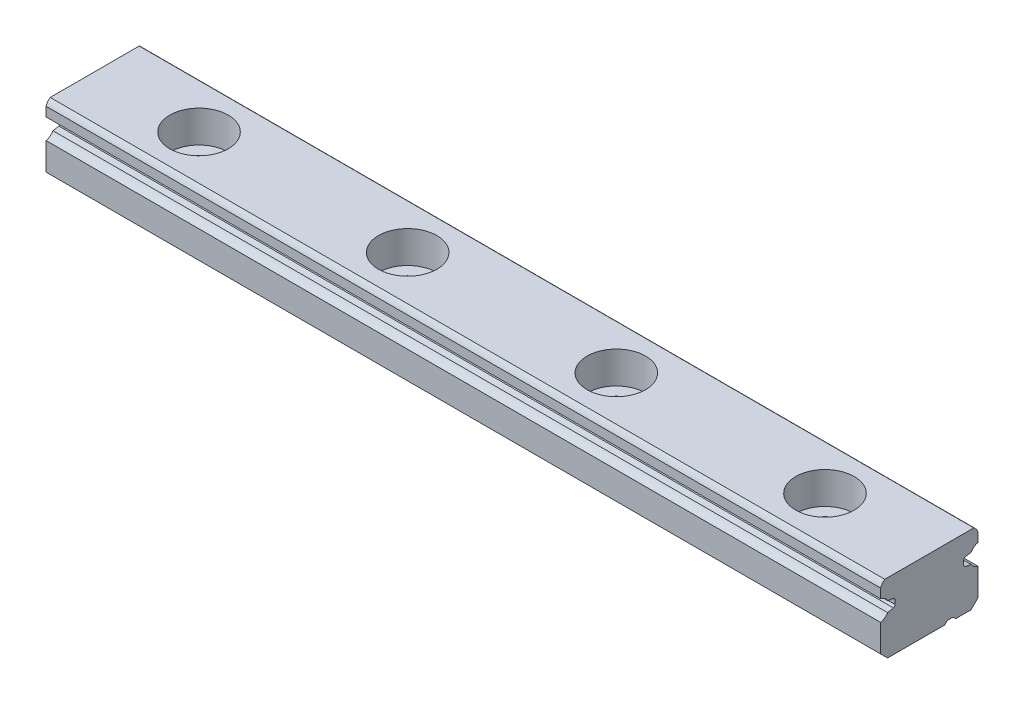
from build123d import *

# Parameters (mm, degrees)
EXTRUDE1_DEPTH  = 60
SKETCH6_R       = 0.5
EXTRUDE2_DEPTH  = 61.309617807
LPATTERN1_COUNT = 3
LPATTERN1_PITCH = 15


with BuildPart() as part:
    # Sketch1 → Extrude1 (new body)
    with BuildSketch(Plane(origin=(0, 0, 0), x_dir=(0, 0, -1), z_dir=(1, 0, 0))):
        with BuildLine():
            Line((-3.5, 0.5), (-3, 0))
            Line((-3, 0), (3, 0))
            Line((3, 0), (3.5, 0.5))
            Line((3.5, 0.5), (3.5, 2.465153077))
            ThreePointArc((3.5, 2.465153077), (3.211148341, 2.591798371), (2.999904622, 2.826))
            Line((2.999904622, 2.826), (2.572, 2.90145113))
            ThreePointArc((2.572, 2.90145113), (2.501845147, 2.968757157), (2.45, 3.051))
            Line((2.45, 3.051), (2.45, 3.349))
            ThreePointArc((2.45, 3.349), (2.501845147, 3.431242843), (2.572, 3.49854887))
            Line((2.572, 3.49854887), (2.999904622, 3.574))
            ThreePointArc((2.999904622, 3.574), (3.211148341, 3.808201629), (3.5, 3.934846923))
            Line((3.5, 3.934846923), (3.5, 4.6))
            ThreePointArc((3.5, 4.6), (3.382052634, 4.824039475), (3.2, 5))
            Line((3.2, 5), (-3.2, 5))
            ThreePointArc((-3.2, 5), (-3.382052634, 4.824039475), (-3.5, 4.6))
            Line((-3.5, 4.6), (-3.5, 3.934846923))
            ThreePointArc((-3.5, 3.934846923), (-3.211148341, 3.808201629), (-2.999904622, 3.574))
            Line((-2.999904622, 3.574), (-2.572, 3.49854887))
            ThreePointArc((-2.572, 3.49854887), (-2.501845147, 3.431242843), (-2.45, 3.349))
            Line((-2.45, 3.349), (-2.45, 3.051))
            ThreePointArc((-2.45, 3.051), (-2.501845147, 2.968757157), (-2.572, 2.90145113))
            Line((-2.572, 2.90145113), (-2.999904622, 2.826))
            ThreePointArc((-2.999904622, 2.826), (-3.211148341, 2.591798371), (-3.5, 2.465153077))
            Line((-3.5, 2.465153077), (-3.5, 0.5))
        make_face()
    extrude(amount=EXTRUDE1_DEPTH)

    # Sketch2 → Cut-Revolve1 (revolve, cut)
    with BuildSketch(Plane(origin=(0, 0, 0), x_dir=(-1, 0, 0), z_dir=(0, 0, -1)), mode=Mode.PRIVATE) as cut_revolve1_sk:
        Polygon((-7.5, 5), (-5.4, 5), (-5.4, 2.7), (-6.3, 2.7), (-6.3, 0.2), (-6.1, 0), (-7.5, 0), align=None)
    revolve(cut_revolve1_sk.sketch.rotate(Axis((7.5, 0, 0), (0, 1, 0)), 90), axis=Axis((7.5, 0, 0), (0, 1, 0)), mode=Mode.SUBTRACT)

    # Sketch3 → Cut-Revolve2 (revolve, cut)
    with BuildSketch(Plane(origin=(45, 0, 0), x_dir=(-1, 0, 0), z_dir=(0, 0, -1)), mode=Mode.PRIVATE) as cut_revolve2_sk:
        Polygon((-7.5, 5), (-5.4, 5), (-5.4, 2.7), (-6.3, 2.7), (-6.3, 0.2), (-6.1, 0), (-7.5, 0), align=None)
    cut_revolve2 = revolve(cut_revolve2_sk.sketch.rotate(Axis((52.5, 0, 0), (0, 1, 0)), 90), axis=Axis((52.5, 0, 0), (0, 1, 0)), mode=Mode.SUBTRACT)

    # Sketch6 → Extrude2 (cut, through all)
    with BuildSketch(Plane(origin=(0, 0, 0), x_dir=(0, 0, -1), z_dir=(1, 0, 0))):
        with Locations((1.5, -0.3)):
            Circle(SKETCH6_R)
    extrude(amount=EXTRUDE2_DEPTH, mode=Mode.SUBTRACT)

    # LPattern1: Cut-Revolve2 ×3
    with Locations(*[(-i * LPATTERN1_PITCH, 0, 0) for i in range(1, LPATTERN1_COUNT)]):
        add(cut_revolve2, mode=Mode.SUBTRACT)


solid = part.part
